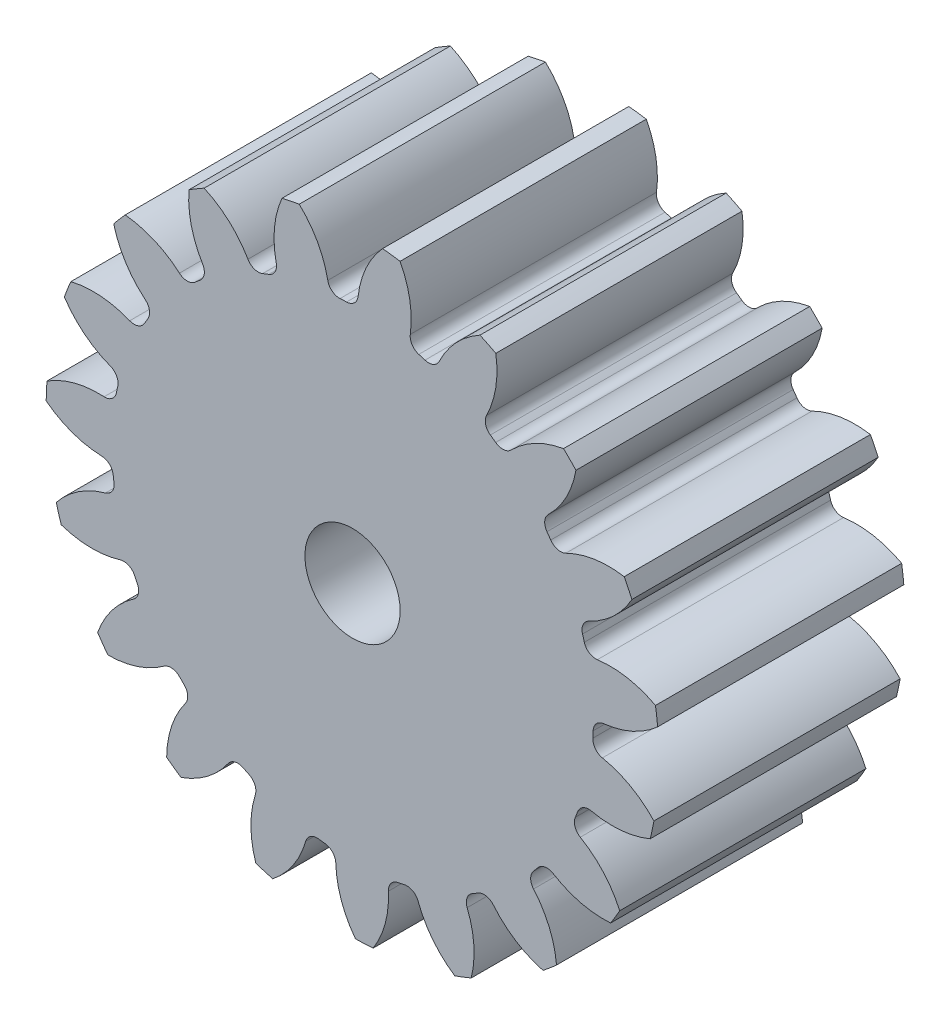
from build123d import *

# Parameters (mm, degrees)
SKETCH3_R         = 118.533333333
GEARBODY_DEPTH    = 95.25
TOOTHCUT_DEPTH    = 193.802657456
CIRPATTERN1_COUNT = 19
BOREDIA_R         = 18.415
BORE_DEPTH        = 12700


with BuildPart() as part:
    # Sketch3 → gearBody (new body)
    with BuildSketch(Plane.XY):
        Circle(SKETCH3_R)
    extrude(amount=GEARBODY_DEPTH)

    # Sketch2 → toothCut (cut, through all)
    with BuildSketch(Plane.XY):
        with BuildLine():
            ThreePointArc((92.977219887, -5.390209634), (93.041725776, -4.129775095), (93.089145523, -2.868582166))
            ThreePointArc((93.089145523, -2.868582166), (94.307212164, 0.108239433), (97.178890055, 1.556900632))
            ThreePointArc((97.178890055, 1.556900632), (108.650561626, 4.733801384), (118.533333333, 11.368767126))
            ThreePointArc((118.533333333, 11.368767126), (118.960159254, -5.280197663), (117.059947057, -21.825873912))
            ThreePointArc((117.059947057, -21.825873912), (107.803884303, -14.34140671), (96.658792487, -10.160632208))
            ThreePointArc((96.658792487, -10.160632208), (93.926756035, -8.463243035), (92.977219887, -5.390209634))
        make_face()
    toothcut = extrude(amount=TOOTHCUT_DEPTH, mode=Mode.SUBTRACT)

    # CirPattern1: toothCut ×19 about axis
    cirpattern1_axis = Axis((0, 0, 0), (0, 0, 1))
    for i in range(1, CIRPATTERN1_COUNT):
        add(toothcut.rotate(cirpattern1_axis, i * 360 / CIRPATTERN1_COUNT), mode=Mode.SUBTRACT)

    # boreDia → bore (cut, symmetric)
    with BuildSketch(Plane.XY):
        Circle(BOREDIA_R)
    extrude(amount=BORE_DEPTH, both=True, mode=Mode.SUBTRACT)


solid = part.part
